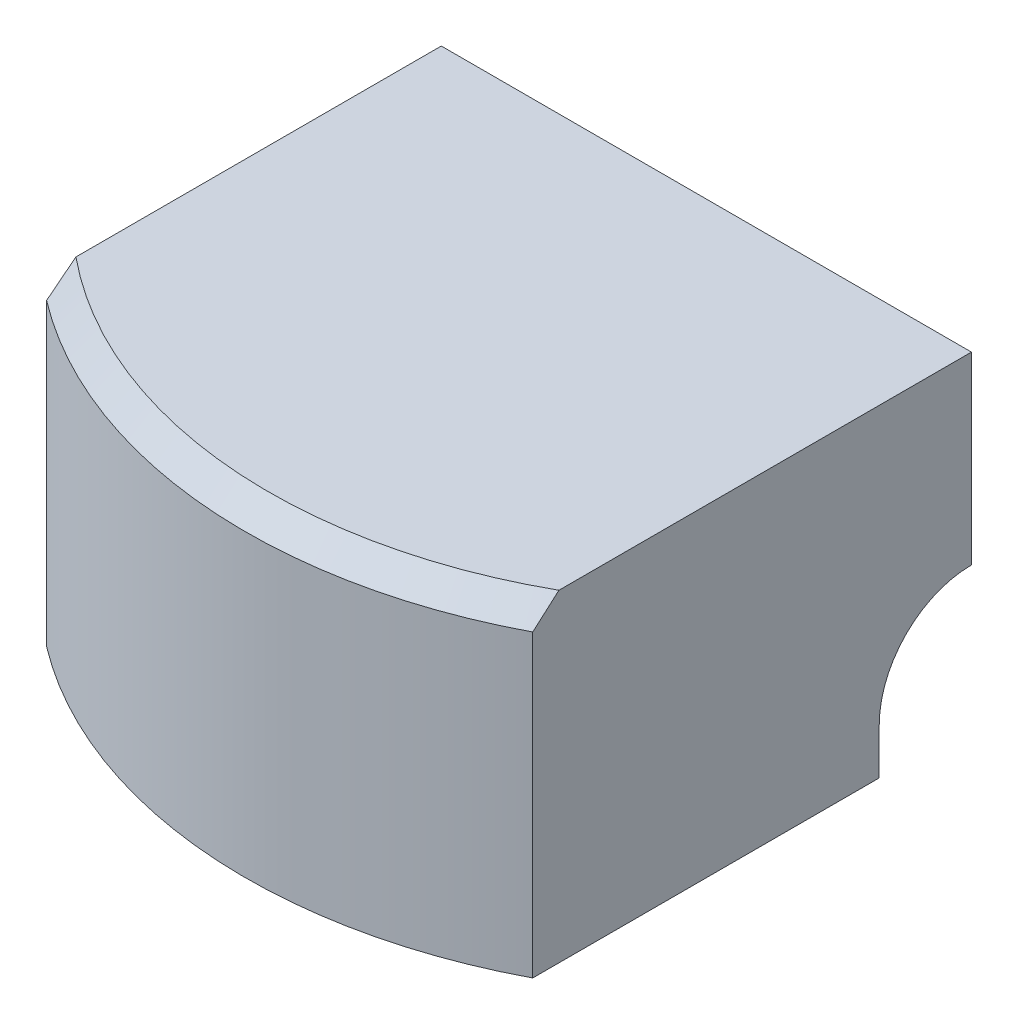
ISO-10303-21;
HEADER;
FILE_DESCRIPTION(('STEP AP214'),'2;1');
FILE_NAME('part.step','',(''),(''),'','','');
FILE_SCHEMA(('AUTOMOTIVE_DESIGN { 1 0 10303 214 1 1 1 1 }'));
ENDSEC;
DATA;
#1=APPLICATION_CONTEXT('core data for automotive mechanical design processes');
#2=APPLICATION_PROTOCOL_DEFINITION('international standard','automotive_design',2000,#1);
#3=PRODUCT_CONTEXT('',#1,'mechanical');
#4=PRODUCT('Part','Part','',(#3));
#5=PRODUCT_RELATED_PRODUCT_CATEGORY('part','',(#4));
#6=PRODUCT_DEFINITION_FORMATION('','',#4);
#7=PRODUCT_DEFINITION_CONTEXT('part definition',#1,'design');
#8=PRODUCT_DEFINITION('design','',#6,#7);
#9=PRODUCT_DEFINITION_SHAPE('','',#8);
#10=(LENGTH_UNIT() NAMED_UNIT(*) SI_UNIT(.MILLI.,.METRE.));
#11=(NAMED_UNIT(*) PLANE_ANGLE_UNIT() SI_UNIT($,.RADIAN.));
#12=(NAMED_UNIT(*) SI_UNIT($,.STERADIAN.) SOLID_ANGLE_UNIT());
#13=UNCERTAINTY_MEASURE_WITH_UNIT(LENGTH_MEASURE(1.E-05),#10,'distance_accuracy_value','');
#14=(GEOMETRIC_REPRESENTATION_CONTEXT(3) GLOBAL_UNCERTAINTY_ASSIGNED_CONTEXT((#13)) GLOBAL_UNIT_ASSIGNED_CONTEXT((#10,
#11,#12)) REPRESENTATION_CONTEXT('',''));
#15=CARTESIAN_POINT('',(0.,0.,0.));
#16=DIRECTION('',(0.,0.,1.));
#17=DIRECTION('',(1.,0.,0.));
#18=AXIS2_PLACEMENT_3D('',#15,#16,#17);
#19=CARTESIAN_POINT('',(0.,12.7,0.));
#20=DIRECTION('',(0.,-1.,0.));
#21=DIRECTION('',(1.,0.,0.));
#22=AXIS2_PLACEMENT_3D('',#19,#20,#21);
#23=SPHERICAL_SURFACE('',#22,25.4);
#24=CARTESIAN_POINT('',(0.,12.7,-4.33050426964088E-13));
#25=DIRECTION('',(1.,0.,0.));
#26=DIRECTION('',(0.,0.,-1.));
#27=AXIS2_PLACEMENT_3D('',#24,#25,#26);
#28=CIRCLE('',#27,25.4);
#29=CARTESIAN_POINT('',(0.,12.7,25.3999999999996));
#30=VERTEX_POINT('',#29);
#31=CARTESIAN_POINT('',(0.,38.1,-4.33050426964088E-13));
#32=VERTEX_POINT('',#31);
#33=EDGE_CURVE('E202',#30,#32,#28,.F.);
#34=ORIENTED_EDGE('',*,*,#33,.F.);
#35=CARTESIAN_POINT('',(0.,12.7,0.));
#36=DIRECTION('',(0.,-1.,0.));
#37=DIRECTION('',(0.,0.,-1.));
#38=AXIS2_PLACEMENT_3D('',#35,#36,#37);
#39=CIRCLE('',#38,25.4);
#40=CARTESIAN_POINT('',(-25.4,12.7,0.));
#41=VERTEX_POINT('',#40);
#42=EDGE_CURVE('E184',#30,#41,#39,.T.);
#43=ORIENTED_EDGE('',*,*,#42,.T.);
#44=CARTESIAN_POINT('',(0.,12.7,0.));
#45=DIRECTION('',(0.,0.,1.));
#46=DIRECTION('',(-1.,0.,0.));
#47=AXIS2_PLACEMENT_3D('',#44,#45,#46);
#48=CIRCLE('',#47,25.4);
#49=EDGE_CURVE('E189',#32,#41,#48,.T.);
#50=ORIENTED_EDGE('',*,*,#49,.F.);
#51=EDGE_LOOP('',(#34,#43,#50));
#52=FACE_BOUND('',#51,.T.);
#53=ADVANCED_FACE('F33',(#52),#23,.F.);
#54=CARTESIAN_POINT('',(0.,0.,0.));
#55=DIRECTION('',(0.,-1.,0.));
#56=DIRECTION('',(0.,0.,-1.));
#57=AXIS2_PLACEMENT_3D('',#54,#55,#56);
#58=CYLINDRICAL_SURFACE('',#57,25.4);
#59=DIRECTION('',(0.,1.,0.));
#60=VECTOR('',#59,1.);
#61=CARTESIAN_POINT('',(0.,12.7,25.3999999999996));
#62=LINE('',#61,#60);
#63=CARTESIAN_POINT('',(0.,0.,25.3999999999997));
#64=VERTEX_POINT('',#63);
#65=EDGE_CURVE('E203',#64,#30,#62,.T.);
#66=ORIENTED_EDGE('',*,*,#65,.F.);
#67=CARTESIAN_POINT('',(0.,0.,0.));
#68=DIRECTION('',(0.,-1.,0.));
#69=DIRECTION('',(0.,0.,-1.));
#70=AXIS2_PLACEMENT_3D('',#67,#68,#69);
#71=CIRCLE('',#70,25.4);
#72=CARTESIAN_POINT('',(-25.4,0.,0.));
#73=VERTEX_POINT('',#72);
#74=EDGE_CURVE('E117',#64,#73,#71,.T.);
#75=ORIENTED_EDGE('',*,*,#74,.T.);
#76=DIRECTION('',(0.,1.,0.));
#77=VECTOR('',#76,1.);
#78=CARTESIAN_POINT('',(-25.4,0.,0.));
#79=LINE('',#78,#77);
#80=EDGE_CURVE('E191',#73,#41,#79,.T.);
#81=ORIENTED_EDGE('',*,*,#80,.T.);
#82=ORIENTED_EDGE('',*,*,#42,.F.);
#83=EDGE_LOOP('',(#66,#75,#81,#82));
#84=FACE_BOUND('',#83,.T.);
#85=ADVANCED_FACE('F162',(#84),#58,.F.);
#86=CARTESIAN_POINT('',(0.,88.9,0.));
#87=DIRECTION('',(0.,-1.,0.));
#88=DIRECTION('',(0.,0.,-1.));
#89=AXIS2_PLACEMENT_3D('',#86,#87,#88);
#90=PLANE('',#89);
#91=DIRECTION('',(1.,0.,0.));
#92=VECTOR('',#91,1.);
#93=CARTESIAN_POINT('',(0.,88.9,0.));
#94=LINE('',#93,#92);
#95=CARTESIAN_POINT('',(-82.55,88.9,5.76443569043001E-13));
#96=VERTEX_POINT('',#95);
#97=CARTESIAN_POINT('',(63.5,88.9,0.));
#98=VERTEX_POINT('',#97);
#99=EDGE_CURVE('E186',#96,#98,#94,.T.);
#100=ORIENTED_EDGE('',*,*,#99,.F.);
#101=DIRECTION('',(0.,0.,-1.));
#102=VECTOR('',#101,1.);
#103=CARTESIAN_POINT('',(-82.55,88.9,0.));
#104=LINE('',#103,#102);
#105=CARTESIAN_POINT('',(-82.55,88.9,100.653008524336));
#106=VERTEX_POINT('',#105);
#107=EDGE_CURVE('E56',#106,#96,#104,.T.);
#108=ORIENTED_EDGE('',*,*,#107,.F.);
#109=CARTESIAN_POINT('',(0.,88.9,0.));
#110=DIRECTION('',(0.,-1.,0.));
#111=DIRECTION('',(0.,0.,-1.));
#112=AXIS2_PLACEMENT_3D('',#109,#110,#111);
#113=CIRCLE('',#112,130.175);
#114=CARTESIAN_POINT('',(63.5,88.9,113.6366165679));
#115=VERTEX_POINT('',#114);
#116=EDGE_CURVE('E11',#115,#106,#113,.T.);
#117=ORIENTED_EDGE('',*,*,#116,.F.);
#118=DIRECTION('',(0.,0.,1.));
#119=VECTOR('',#118,1.);
#120=CARTESIAN_POINT('',(63.5,88.9,0.));
#121=LINE('',#120,#119);
#122=EDGE_CURVE('E125',#98,#115,#121,.T.);
#123=ORIENTED_EDGE('',*,*,#122,.F.);
#124=EDGE_LOOP('',(#100,#108,#117,#123));
#125=FACE_BOUND('',#124,.T.);
#126=ADVANCED_FACE('F35',(#125),#90,.F.);
#127=CARTESIAN_POINT('',(0.,88.9,0.));
#128=DIRECTION('',(0.,-1.,0.));
#129=DIRECTION('',(0.,0.,-1.));
#130=AXIS2_PLACEMENT_3D('',#127,#128,#129);
#131=CONICAL_SURFACE('',#130,130.175,0.785398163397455);
#132=ORIENTED_EDGE('',*,*,#116,.T.);
#133=CARTESIAN_POINT('',(-82.55,102.717281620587,-82.0037567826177));
#134=CARTESIAN_POINT('',(-82.55,103.527269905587,-80.8543967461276));
#135=CARTESIAN_POINT('',(-82.55,104.33157883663,-79.7010151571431));
#136=CARTESIAN_POINT('',(-82.55,105.927657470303,-77.3855538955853));
#137=CARTESIAN_POINT('',(-82.55,106.719426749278,-76.2234739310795));
#138=CARTESIAN_POINT('',(-82.55,108.289541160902,-73.8895175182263));
#139=CARTESIAN_POINT('',(-82.55,109.067880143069,-72.7176369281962));
#140=CARTESIAN_POINT('',(-82.55,110.609364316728,-70.3639304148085));
#141=CARTESIAN_POINT('',(-82.55,111.372509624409,-69.1821045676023));
#142=CARTESIAN_POINT('',(-82.55,112.891581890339,-66.7927901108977));
#143=CARTESIAN_POINT('',(-82.55,113.647295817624,-65.5851659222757));
#144=CARTESIAN_POINT('',(-82.55,115.139695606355,-63.1582197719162));
#145=CARTESIAN_POINT('',(-82.55,115.876381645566,-61.9388979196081));
#146=CARTESIAN_POINT('',(-82.55,117.32858539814,-59.4878558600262));
#147=CARTESIAN_POINT('',(-82.55,118.044105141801,-58.2561368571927));
#148=CARTESIAN_POINT('',(-82.55,119.45170535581,-55.7793565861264));
#149=CARTESIAN_POINT('',(-82.55,120.143785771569,-54.534295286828));
#150=CARTESIAN_POINT('',(-82.55,121.525373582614,-51.9866513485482));
#151=CARTESIAN_POINT('',(-82.55,122.213962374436,-50.6835696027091));
#152=CARTESIAN_POINT('',(-82.55,123.559923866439,-48.0613499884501));
#153=CARTESIAN_POINT('',(-82.55,124.21729651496,-46.7422120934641));
#154=CARTESIAN_POINT('',(-82.55,125.497266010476,-44.0867705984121));
#155=CARTESIAN_POINT('',(-82.55,126.119855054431,-42.7504632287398));
#156=CARTESIAN_POINT('',(-82.55,127.325973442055,-40.060290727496));
#157=CARTESIAN_POINT('',(-82.55,127.909502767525,-38.7064255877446));
#158=CARTESIAN_POINT('',(-82.55,129.030141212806,-35.9875043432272));
#159=CARTESIAN_POINT('',(-82.55,129.567468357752,-34.6225383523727));
#160=CARTESIAN_POINT('',(-82.55,130.59414127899,-31.874507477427));
#161=CARTESIAN_POINT('',(-82.55,131.083483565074,-30.4914412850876));
#162=CARTESIAN_POINT('',(-82.55,132.008747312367,-27.7083227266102));
#163=CARTESIAN_POINT('',(-82.55,132.444697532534,-26.3082799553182));
#164=CARTESIAN_POINT('',(-82.55,133.258141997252,-23.4914505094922));
#165=CARTESIAN_POINT('',(-82.55,133.635644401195,-22.0746662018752));
#166=CARTESIAN_POINT('',(-82.55,134.308175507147,-19.3033405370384));
#167=CARTESIAN_POINT('',(-82.55,134.606580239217,-17.9496207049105));
#168=CARTESIAN_POINT('',(-82.55,135.142360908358,-15.2302922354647));
#169=CARTESIAN_POINT('',(-82.55,135.379745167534,-13.864685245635));
#170=CARTESIAN_POINT('',(-82.55,135.789986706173,-11.123310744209));
#171=CARTESIAN_POINT('',(-82.55,135.962822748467,-9.74754004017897));
#172=CARTESIAN_POINT('',(-82.55,136.241021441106,-6.98914506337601));
#173=CARTESIAN_POINT('',(-82.55,136.346383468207,-5.60652072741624));
#174=CARTESIAN_POINT('',(-82.55,136.486814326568,-2.85725339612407));
#175=CARTESIAN_POINT('',(-82.55,136.52285390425,-1.49066013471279));
#176=CARTESIAN_POINT('',(-82.55,136.526959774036,1.24262089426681));
#177=CARTESIAN_POINT('',(-82.55,136.495026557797,2.60930866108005));
#178=CARTESIAN_POINT('',(-82.55,136.36373731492,5.33944850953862));
#179=CARTESIAN_POINT('',(-82.55,136.264380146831,6.70290053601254));
#180=CARTESIAN_POINT('',(-82.55,135.999914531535,9.42338949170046));
#181=CARTESIAN_POINT('',(-82.55,135.834805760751,10.7804263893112));
#182=CARTESIAN_POINT('',(-82.55,135.442419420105,13.4788607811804));
#183=CARTESIAN_POINT('',(-82.55,135.21544067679,14.8203019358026));
#184=CARTESIAN_POINT('',(-82.55,134.702337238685,17.4917785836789));
#185=CARTESIAN_POINT('',(-82.55,134.416212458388,18.8218140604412));
#186=CARTESIAN_POINT('',(-82.55,133.788666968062,21.4688052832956));
#187=CARTESIAN_POINT('',(-82.55,133.447243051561,22.7857602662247));
#188=CARTESIAN_POINT('',(-82.55,132.713257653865,25.405295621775));
#189=CARTESIAN_POINT('',(-82.55,132.320695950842,26.7078759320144));
#190=CARTESIAN_POINT('',(-82.55,131.485145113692,29.3088703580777));
#191=CARTESIAN_POINT('',(-82.55,131.041757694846,30.6071561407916));
#192=CARTESIAN_POINT('',(-82.55,130.111533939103,33.1880221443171));
#193=CARTESIAN_POINT('',(-82.55,129.624697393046,34.4706022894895));
#194=CARTESIAN_POINT('',(-82.55,128.611750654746,37.0197899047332));
#195=CARTESIAN_POINT('',(-82.55,128.085649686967,38.2864010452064));
#196=CARTESIAN_POINT('',(-82.55,127.269839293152,40.1747082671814));
#197=CARTESIAN_POINT('',(-82.55,126.993461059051,40.8022054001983));
#198=CARTESIAN_POINT('',(-82.55,126.432246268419,42.0534178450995));
#199=CARTESIAN_POINT('',(-82.55,126.147409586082,42.6771331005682));
#200=CARTESIAN_POINT('',(-82.55,125.26512715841,44.5765641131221));
#201=CARTESIAN_POINT('',(-82.55,124.654751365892,45.8462931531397));
#202=CARTESIAN_POINT('',(-82.55,123.403552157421,48.370706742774));
#203=CARTESIAN_POINT('',(-82.55,122.76272683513,49.6253903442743));
#204=CARTESIAN_POINT('',(-82.55,121.453583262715,52.1206959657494));
#205=CARTESIAN_POINT('',(-82.55,120.785258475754,53.3613145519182));
#206=CARTESIAN_POINT('',(-82.55,119.424035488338,55.8289464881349));
#207=CARTESIAN_POINT('',(-82.55,118.73113771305,57.0559600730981));
#208=CARTESIAN_POINT('',(-82.55,117.322472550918,59.4984939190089));
#209=CARTESIAN_POINT('',(-82.55,116.60668185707,60.714000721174));
#210=CARTESIAN_POINT('',(-82.55,115.155110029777,63.1330115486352));
#211=CARTESIAN_POINT('',(-82.55,114.41932881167,64.3365155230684));
#212=CARTESIAN_POINT('',(-82.55,112.929799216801,66.7321596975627));
#213=CARTESIAN_POINT('',(-82.55,112.176052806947,67.9243011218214));
#214=CARTESIAN_POINT('',(-82.55,110.652222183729,70.2981111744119));
#215=CARTESIAN_POINT('',(-82.55,109.882137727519,71.4797796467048));
#216=CARTESIAN_POINT('',(-82.55,108.324145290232,73.8379021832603));
#217=CARTESIAN_POINT('',(-82.55,107.536179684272,75.0143181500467));
#218=CARTESIAN_POINT('',(-82.55,105.946687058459,77.3579587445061));
#219=CARTESIAN_POINT('',(-82.55,105.145159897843,78.5251832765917));
#220=CARTESIAN_POINT('',(-82.55,102.722092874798,82.0140238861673));
#221=CARTESIAN_POINT('',(-82.55,101.082061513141,84.3228159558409));
#222=CARTESIAN_POINT('',(-82.55,97.7618646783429,88.9093605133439));
#223=CARTESIAN_POINT('',(-82.55,96.0817213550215,91.1871290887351));
#224=CARTESIAN_POINT('',(-82.55,92.6869148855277,95.7167354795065));
#225=CARTESIAN_POINT('',(-82.55,90.9722519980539,97.9685734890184));
#226=CARTESIAN_POINT('',(-82.55,87.5002475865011,102.466938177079));
#227=CARTESIAN_POINT('',(-82.55,85.7426784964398,104.713288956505));
#228=CARTESIAN_POINT('',(-82.55,82.202119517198,109.185848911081));
#229=CARTESIAN_POINT('',(-82.55,80.4191295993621,111.412058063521));
#230=CARTESIAN_POINT('',(-82.55,76.8310941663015,115.846988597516));
#231=CARTESIAN_POINT('',(-82.55,75.0260464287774,118.055708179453));
#232=CARTESIAN_POINT('',(-82.55,71.3969983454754,122.457506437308));
#233=CARTESIAN_POINT('',(-82.55,69.5729980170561,124.650585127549));
#234=CARTESIAN_POINT('',(-82.55,65.9123536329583,129.018252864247));
#235=CARTESIAN_POINT('',(-82.55,64.0757445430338,131.192871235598));
#236=CARTESIAN_POINT('',(-82.55,60.3880924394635,135.529829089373));
#237=CARTESIAN_POINT('',(-82.55,58.5370494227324,137.692168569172));
#238=CARTESIAN_POINT('',(-82.55,54.8223057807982,142.005798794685));
#239=CARTESIAN_POINT('',(-82.55,52.9586056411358,144.157089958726));
#240=CARTESIAN_POINT('',(-82.55,49.2199273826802,148.449841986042));
#241=CARTESIAN_POINT('',(-82.55,47.3449492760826,150.591302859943));
#242=CARTESIAN_POINT('',(-82.55,43.6122410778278,154.83436287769));
#243=CARTESIAN_POINT('',(-82.55,41.754655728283,156.936089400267));
#244=CARTESIAN_POINT('',(-82.55,38.0307471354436,161.131787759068));
#245=CARTESIAN_POINT('',(-82.55,36.1644238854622,163.225759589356));
#246=CARTESIAN_POINT('',(-82.55,32.423071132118,167.407625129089));
#247=CARTESIAN_POINT('',(-82.55,30.548038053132,169.495515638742));
#248=CARTESIAN_POINT('',(-82.55,26.7908777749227,173.664901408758));
#249=CARTESIAN_POINT('',(-82.55,24.9087505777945,175.746396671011));
#250=CARTESIAN_POINT('',(-82.55,21.160989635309,179.878293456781));
#251=CARTESIAN_POINT('',(-82.55,19.2954334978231,181.928765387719));
#252=CARTESIAN_POINT('',(-82.55,15.5586191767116,186.024507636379));
#253=CARTESIAN_POINT('',(-82.55,13.6873609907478,188.069777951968));
#254=CARTESIAN_POINT('',(-82.55,9.94052927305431,192.154589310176));
#255=CARTESIAN_POINT('',(-82.55,8.06495818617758,194.194132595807));
#256=CARTESIAN_POINT('',(-82.55,4.3090600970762,198.268829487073));
#257=CARTESIAN_POINT('',(-82.55,2.42873310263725,200.303983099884));
#258=CARTESIAN_POINT('',(-82.55,0.54624321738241,202.337132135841));
#259=B_SPLINE_CURVE_WITH_KNOTS('',3,(#133,#134,#135,#136,#137,#138,#139,#140,#141,#142,#143,
#144,#145,#146,#147,#148,#149,#150,#151,#152,#153,#154,#155,#156,#157,#158,#159,#160,#161,#162,
#163,#164,#165,#166,#167,#168,#169,#170,#171,#172,#173,#174,#175,#176,#177,#178,#179,#180,#181,
#182,#183,#184,#185,#186,#187,#188,#189,#190,#191,#192,#193,#194,#195,#196,#197,#198,#199,#200,
#201,#202,#203,#204,#205,#206,#207,#208,#209,#210,#211,#212,#213,#214,#215,#216,#217,#218,#219,
#220,#221,#222,#223,#224,#225,#226,#227,#228,#229,#230,#231,#232,#233,#234,#235,#236,#237,#238,
#239,#240,#241,#242,#243,#244,#245,#246,#247,#248,#249,#250,#251,#252,#253,#254,#255,#256,#257,
#258),.UNSPECIFIED.,.F.,.F.,(4,2,2,2,2,2,2,2,2,2,2,2,2,2,2,2,2,2,2,2,2,2,2,2,2,2,2,2,2,2,2,2,2,
2,2,2,2,2,2,2,2,2,2,2,2,2,2,2,2,2,2,2,2,2,2,2,2,2,2,2,2,2,4),(0.,4.21829773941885,
8.4367376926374,12.6570608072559,16.8773516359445,21.1509652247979,25.4245388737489,
29.6977012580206,33.9708735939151,38.3919862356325,42.8131061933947,47.235213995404,
51.6573238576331,56.0572673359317,60.4575306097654,64.8554132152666,69.2526813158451,
73.4100332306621,77.5668178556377,81.7249689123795,85.8831583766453,89.9826828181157,
94.082177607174,98.1817418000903,102.281326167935,106.361450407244,110.441580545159,
114.521947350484,118.602331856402,122.717214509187,126.832116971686,130.946055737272,
133.003000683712,135.059976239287,139.285934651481,143.512157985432,147.739391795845,
151.966552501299,156.198163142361,160.429791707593,164.66095908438,168.892189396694,
173.139859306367,177.387573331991,185.882969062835,194.37377744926,202.864522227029,
211.420961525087,219.97741046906,228.534728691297,237.092039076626,245.631223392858,
254.170409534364,262.70926993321,271.248121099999,279.663015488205,288.077916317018,
296.496646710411,304.915374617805,313.231769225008,321.548167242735,329.860652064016,
338.173123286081),.UNSPECIFIED.);
#260=CARTESIAN_POINT('',(-82.55,82.5500000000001,108.740853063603));
#261=VERTEX_POINT('',#260);
#262=EDGE_CURVE('E128',#106,#261,#259,.T.);
#263=ORIENTED_EDGE('',*,*,#262,.T.);
#264=CARTESIAN_POINT('',(0.,82.5500000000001,0.));
#265=DIRECTION('',(0.,-1.,0.));
#266=DIRECTION('',(0.,0.,-1.));
#267=AXIS2_PLACEMENT_3D('',#264,#265,#266);
#268=CIRCLE('',#267,136.525);
#269=CARTESIAN_POINT('',(63.5,82.5500000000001,120.858701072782));
#270=VERTEX_POINT('',#269);
#271=EDGE_CURVE('E41',#270,#261,#268,.T.);
#272=ORIENTED_EDGE('',*,*,#271,.F.);
#273=CARTESIAN_POINT('',(63.5,0.546243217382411,209.09942023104));
#274=CARTESIAN_POINT('',(63.5,2.40256457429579,207.159382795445));
#275=CARTESIAN_POINT('',(63.5,4.25775280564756,205.218261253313));
#276=CARTESIAN_POINT('',(63.5,7.96565589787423,201.333655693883));
#277=CARTESIAN_POINT('',(63.5,9.81837075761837,199.390171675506));
#278=CARTESIAN_POINT('',(63.5,15.3725169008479,193.555861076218));
#279=CARTESIAN_POINT('',(63.5,19.0699248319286,189.661201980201));
#280=CARTESIAN_POINT('',(63.5,26.4529018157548,181.858780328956));
#281=CARTESIAN_POINT('',(63.5,30.138467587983,177.951014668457));
#282=CARTESIAN_POINT('',(63.5,37.494160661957,170.120993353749));
#283=CARTESIAN_POINT('',(63.5,41.1642880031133,166.198737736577));
#284=CARTESIAN_POINT('',(63.5,48.5005967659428,158.320715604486));
#285=CARTESIAN_POINT('',(63.5,52.166701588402,154.364877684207));
#286=CARTESIAN_POINT('',(63.5,57.6481876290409,148.414819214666));
#287=CARTESIAN_POINT('',(63.5,59.4724109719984,146.428742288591));
#288=CARTESIAN_POINT('',(63.5,63.1142334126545,142.450525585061));
#289=CARTESIAN_POINT('',(63.5,64.9318325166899,140.458385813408));
#290=CARTESIAN_POINT('',(63.5,68.5593672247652,136.467569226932));
#291=CARTESIAN_POINT('',(63.5,70.3693037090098,134.468893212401));
#292=CARTESIAN_POINT('',(63.5,73.9807494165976,130.463945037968));
#293=CARTESIAN_POINT('',(63.5,75.7822586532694,128.45767289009));
#294=CARTESIAN_POINT('',(63.5,79.375682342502,124.436584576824));
#295=CARTESIAN_POINT('',(63.5,81.1675968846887,122.421768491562));
#296=CARTESIAN_POINT('',(63.5,84.7404680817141,118.382449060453));
#297=CARTESIAN_POINT('',(63.5,86.5214247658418,116.357945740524));
#298=CARTESIAN_POINT('',(63.5,90.132880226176,112.22683004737));
#299=CARTESIAN_POINT('',(63.5,91.9629300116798,110.119824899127));
#300=CARTESIAN_POINT('',(63.5,95.607309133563,105.892250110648));
#301=CARTESIAN_POINT('',(63.5,97.4216384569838,103.771680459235));
#302=CARTESIAN_POINT('',(63.5,101.032085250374,99.5145828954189));
#303=CARTESIAN_POINT('',(63.5,102.828200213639,97.3780528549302));
#304=CARTESIAN_POINT('',(63.5,106.398550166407,93.0867843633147));
#305=CARTESIAN_POINT('',(63.5,108.172785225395,90.9320459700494));
#306=CARTESIAN_POINT('',(63.5,111.694944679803,86.6014704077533));
#307=CARTESIAN_POINT('',(63.5,113.44287161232,84.4256353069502));
#308=CARTESIAN_POINT('',(63.5,116.041024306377,81.1430595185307));
#309=CARTESIAN_POINT('',(63.5,116.903131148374,80.0457144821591));
#310=CARTESIAN_POINT('',(63.5,118.618578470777,77.844196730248));
#311=CARTESIAN_POINT('',(63.5,119.471918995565,76.7400240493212));
#312=CARTESIAN_POINT('',(63.5,121.168718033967,74.5244743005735));
#313=CARTESIAN_POINT('',(63.5,122.012178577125,73.4130987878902));
#314=CARTESIAN_POINT('',(63.5,123.68830984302,71.1822486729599));
#315=CARTESIAN_POINT('',(63.5,124.520980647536,70.062774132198));
#316=CARTESIAN_POINT('',(63.5,126.174266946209,67.8150130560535));
#317=CARTESIAN_POINT('',(63.5,126.994882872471,66.686726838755));
#318=CARTESIAN_POINT('',(63.5,128.622646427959,64.420492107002));
#319=CARTESIAN_POINT('',(63.5,129.429794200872,63.2825436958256));
#320=CARTESIAN_POINT('',(63.5,131.121575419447,60.8636705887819));
#321=CARTESIAN_POINT('',(63.5,132.004357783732,59.581449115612));
#322=CARTESIAN_POINT('',(63.5,133.748413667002,57.0024451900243));
#323=CARTESIAN_POINT('',(63.5,134.609687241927,55.7056627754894));
#324=CARTESIAN_POINT('',(63.5,136.307716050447,53.0957223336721));
#325=CARTESIAN_POINT('',(63.5,137.144466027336,51.7825608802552));
#326=CARTESIAN_POINT('',(63.5,138.789459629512,49.1384714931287));
#327=CARTESIAN_POINT('',(63.5,139.597703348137,47.8075436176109));
#328=CARTESIAN_POINT('',(63.5,141.181109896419,45.1262522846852));
#329=CARTESIAN_POINT('',(63.5,141.956275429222,43.7758904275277));
#330=CARTESIAN_POINT('',(63.5,143.468258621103,41.0537503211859));
#331=CARTESIAN_POINT('',(63.5,144.205075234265,39.6819714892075));
#332=CARTESIAN_POINT('',(63.5,145.63375298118,36.9157026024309));
#333=CARTESIAN_POINT('',(63.5,146.32562883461,35.5212201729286));
#334=CARTESIAN_POINT('',(63.5,147.657218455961,32.7075708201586));
#335=CARTESIAN_POINT('',(63.5,148.296936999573,31.2884061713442));
#336=CARTESIAN_POINT('',(63.5,149.312990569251,28.9004471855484));
#337=CARTESIAN_POINT('',(63.5,149.706173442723,27.9388092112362));
#338=CARTESIAN_POINT('',(63.5,150.462662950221,26.0037668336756));
#339=CARTESIAN_POINT('',(63.5,150.825968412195,25.0303619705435));
#340=CARTESIAN_POINT('',(63.5,151.519676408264,23.0718509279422));
#341=CARTESIAN_POINT('',(63.5,151.850078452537,22.086744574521));
#342=CARTESIAN_POINT('',(63.5,152.474802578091,20.1052270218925));
#343=CARTESIAN_POINT('',(63.5,152.769128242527,19.1088169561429));
#344=CARTESIAN_POINT('',(63.5,153.317525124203,17.1089623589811));
#345=CARTESIAN_POINT('',(63.5,153.571743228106,16.1055582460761));
#346=CARTESIAN_POINT('',(63.5,154.038180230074,14.0890039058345));
#347=CARTESIAN_POINT('',(63.5,154.250399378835,13.0758537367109));
#348=CARTESIAN_POINT('',(63.5,154.629985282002,11.04122423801));
#349=CARTESIAN_POINT('',(63.5,154.797355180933,10.0197454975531));
#350=CARTESIAN_POINT('',(63.5,155.084817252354,7.97012911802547));
#351=CARTESIAN_POINT('',(63.5,155.204909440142,6.9419914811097));
#352=CARTESIAN_POINT('',(63.5,155.397010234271,4.86956746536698));
#353=CARTESIAN_POINT('',(63.5,155.46846394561,3.82522936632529));
#354=CARTESIAN_POINT('',(63.5,155.55990811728,1.73429303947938));
#355=CARTESIAN_POINT('',(63.5,155.579898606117,0.687694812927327));
#356=CARTESIAN_POINT('',(63.5,155.568074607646,-1.40519590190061));
#357=CARTESIAN_POINT('',(63.5,155.536260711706,-2.45148839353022));
#358=CARTESIAN_POINT('',(63.5,155.421371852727,-4.54124596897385));
#359=CARTESIAN_POINT('',(63.5,155.338296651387,-5.58471103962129));
#360=CARTESIAN_POINT('',(63.5,155.122002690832,-7.66895489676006));
#361=CARTESIAN_POINT('',(63.5,154.988663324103,-8.70972111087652));
#362=CARTESIAN_POINT('',(63.5,154.673973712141,-10.7839301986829));
#363=CARTESIAN_POINT('',(63.5,154.492623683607,-11.8173731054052));
#364=CARTESIAN_POINT('',(63.5,154.084554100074,-13.8753546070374));
#365=CARTESIAN_POINT('',(63.5,153.857829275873,-14.8998921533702));
#366=CARTESIAN_POINT('',(63.5,153.362051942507,-16.9387008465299));
#367=CARTESIAN_POINT('',(63.5,153.092996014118,-17.9529711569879));
#368=CARTESIAN_POINT('',(63.5,152.389978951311,-20.4099907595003));
#369=CARTESIAN_POINT('',(63.5,151.935254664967,-21.8468197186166));
#370=CARTESIAN_POINT('',(63.5,150.954847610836,-24.696063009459));
#371=CARTESIAN_POINT('',(63.5,150.429154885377,-26.1084738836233));
#372=CARTESIAN_POINT('',(63.5,149.315740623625,-28.9094591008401));
#373=CARTESIAN_POINT('',(63.5,148.72798354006,-30.2980192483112));
#374=CARTESIAN_POINT('',(63.5,147.499093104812,-33.0511415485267));
#375=CARTESIAN_POINT('',(63.5,146.857961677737,-34.4157045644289));
#376=CARTESIAN_POINT('',(63.5,145.525412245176,-37.1308490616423));
#377=CARTESIAN_POINT('',(63.5,144.833697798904,-38.4812845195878));
#378=CARTESIAN_POINT('',(63.5,143.41013769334,-41.1607782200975));
#379=CARTESIAN_POINT('',(63.5,142.678291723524,-42.4898362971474));
#380=CARTESIAN_POINT('',(63.5,141.180257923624,-45.1278083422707));
#381=CARTESIAN_POINT('',(63.5,140.414081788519,-46.4367289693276));
#382=CARTESIAN_POINT('',(63.5,138.85184250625,-49.0365631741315));
#383=CARTESIAN_POINT('',(63.5,138.055779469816,-50.3274768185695));
#384=CARTESIAN_POINT('',(63.5,136.405786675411,-52.943549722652));
#385=CARTESIAN_POINT('',(63.5,135.550813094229,-54.2680495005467));
#386=CARTESIAN_POINT('',(63.5,133.816588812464,-56.9010353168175));
#387=CARTESIAN_POINT('',(63.5,132.937338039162,-58.2095213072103));
#388=CARTESIAN_POINT('',(63.5,131.157582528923,-60.8122022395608));
#389=CARTESIAN_POINT('',(63.5,130.257074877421,-62.1063951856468));
#390=CARTESIAN_POINT('',(63.5,128.437578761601,-64.6817010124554));
#391=CARTESIAN_POINT('',(63.5,127.518590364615,-65.9628139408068));
#392=CARTESIAN_POINT('',(63.5,125.682064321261,-68.4888897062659));
#393=CARTESIAN_POINT('',(63.5,124.76483355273,-69.7340759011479));
#394=CARTESIAN_POINT('',(63.5,122.916540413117,-72.2141453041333));
#395=CARTESIAN_POINT('',(63.5,121.985477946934,-73.4490284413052));
#396=CARTESIAN_POINT('',(63.5,120.111566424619,-75.9088016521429));
#397=CARTESIAN_POINT('',(63.5,119.168723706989,-77.1336965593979));
#398=CARTESIAN_POINT('',(63.5,117.272096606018,-79.5749285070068));
#399=CARTESIAN_POINT('',(63.5,116.318312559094,-80.79126580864));
#400=CARTESIAN_POINT('',(63.5,115.359687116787,-82.0037567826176));
#401=B_SPLINE_CURVE_WITH_KNOTS('',3,(#273,#274,#275,#276,#277,#278,#279,#280,#281,#282,#283,
#284,#285,#286,#287,#288,#289,#290,#291,#292,#293,#294,#295,#296,#297,#298,#299,#300,#301,#302,
#303,#304,#305,#306,#307,#308,#309,#310,#311,#312,#313,#314,#315,#316,#317,#318,#319,#320,#321,
#322,#323,#324,#325,#326,#327,#328,#329,#330,#331,#332,#333,#334,#335,#336,#337,#338,#339,#340,
#341,#342,#343,#344,#345,#346,#347,#348,#349,#350,#351,#352,#353,#354,#355,#356,#357,#358,#359,
#360,#361,#362,#363,#364,#365,#366,#367,#368,#369,#370,#371,#372,#373,#374,#375,#376,#377,#378,
#379,#380,#381,#382,#383,#384,#385,#386,#387,#388,#389,#390,#391,#392,#393,#394,#395,#396,#397,
#398,#399,#400),.UNSPECIFIED.,.F.,.F.,(4,2,2,2,2,2,2,2,2,2,2,2,2,2,2,2,2,2,2,2,2,2,2,2,2,2,2,2,
2,2,2,2,2,2,2,2,2,2,2,2,2,2,2,2,2,2,2,2,2,2,2,2,2,2,2,2,2,2,2,2,2,2,2,4),(0.,8.05525012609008,
16.1105039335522,32.2211196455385,48.335868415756,64.4505760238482,80.6307484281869,
88.720892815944,96.8110294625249,104.900210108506,112.989377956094,121.078470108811,
129.167540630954,137.539867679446,145.912201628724,154.285672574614,162.659116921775,
171.031748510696,175.218184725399,179.404599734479,183.590139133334,187.775646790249,
191.96100405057,196.146316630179,200.816302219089,205.486275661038,210.15724291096,
214.828194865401,219.498764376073,224.169461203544,228.838620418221,233.50735162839,
236.623663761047,239.740098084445,242.856578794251,245.97274971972,249.077229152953,
252.181690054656,255.2859332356,258.390175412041,261.529264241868,264.668351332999,
267.807402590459,270.946468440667,274.093114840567,277.23974703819,280.386744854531,
283.533996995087,288.052956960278,292.572551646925,297.094749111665,301.616783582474,
306.16785231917,310.718956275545,315.268521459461,319.818069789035,324.547193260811,
329.276330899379,334.006120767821,338.735893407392,343.375421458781,348.014981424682,
352.652144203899,357.289164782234),.UNSPECIFIED.);
#402=EDGE_CURVE('E138',#270,#115,#401,.T.);
#403=ORIENTED_EDGE('',*,*,#402,.T.);
#404=EDGE_LOOP('',(#132,#263,#272,#403));
#405=FACE_BOUND('',#404,.T.);
#406=ADVANCED_FACE('F147',(#405),#131,.T.);
#407=CARTESIAN_POINT('',(0.,0.,0.));
#408=DIRECTION('',(0.,-1.,0.));
#409=DIRECTION('',(0.,0.,-1.));
#410=AXIS2_PLACEMENT_3D('',#407,#408,#409);
#411=CYLINDRICAL_SURFACE('',#410,136.525);
#412=ORIENTED_EDGE('',*,*,#271,.T.);
#413=DIRECTION('',(0.,-1.,0.));
#414=VECTOR('',#413,1.);
#415=CARTESIAN_POINT('',(-82.55,0.,108.740853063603));
#416=LINE('',#415,#414);
#417=CARTESIAN_POINT('',(-82.55,0.,108.740853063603));
#418=VERTEX_POINT('',#417);
#419=EDGE_CURVE('E178',#261,#418,#416,.T.);
#420=ORIENTED_EDGE('',*,*,#419,.T.);
#421=CARTESIAN_POINT('',(0.,0.,0.));
#422=DIRECTION('',(0.,-1.,0.));
#423=DIRECTION('',(0.,0.,-1.));
#424=AXIS2_PLACEMENT_3D('',#421,#422,#423);
#425=CIRCLE('',#424,136.525);
#426=CARTESIAN_POINT('',(63.5,0.,120.858701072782));
#427=VERTEX_POINT('',#426);
#428=EDGE_CURVE('E180',#427,#418,#425,.T.);
#429=ORIENTED_EDGE('',*,*,#428,.F.);
#430=DIRECTION('',(0.,-1.,0.));
#431=VECTOR('',#430,1.);
#432=CARTESIAN_POINT('',(63.5,0.,120.858701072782));
#433=LINE('',#432,#431);
#434=EDGE_CURVE('E122',#427,#270,#433,.F.);
#435=ORIENTED_EDGE('',*,*,#434,.T.);
#436=EDGE_LOOP('',(#412,#420,#429,#435));
#437=FACE_BOUND('',#436,.T.);
#438=ADVANCED_FACE('F168',(#437),#411,.T.);
#439=CARTESIAN_POINT('',(25.4,0.,-1.77367252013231E-13));
#440=DIRECTION('',(0.,1.,0.));
#441=DIRECTION('',(0.,0.,1.));
#442=AXIS2_PLACEMENT_3D('',#439,#440,#441);
#443=PLANE('',#442);
#444=ORIENTED_EDGE('',*,*,#74,.F.);
#445=DIRECTION('',(1.,0.,0.));
#446=VECTOR('',#445,1.);
#447=CARTESIAN_POINT('',(-45.7905011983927,0.,25.3999999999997));
#448=LINE('',#447,#446);
#449=CARTESIAN_POINT('',(63.5,0.,25.3999999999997));
#450=VERTEX_POINT('',#449);
#451=EDGE_CURVE('E104',#64,#450,#448,.T.);
#452=ORIENTED_EDGE('',*,*,#451,.T.);
#453=DIRECTION('',(0.,0.,1.));
#454=VECTOR('',#453,1.);
#455=CARTESIAN_POINT('',(63.5,0.,0.));
#456=LINE('',#455,#454);
#457=EDGE_CURVE('E114',#450,#427,#456,.T.);
#458=ORIENTED_EDGE('',*,*,#457,.T.);
#459=ORIENTED_EDGE('',*,*,#428,.T.);
#460=DIRECTION('',(0.,0.,-1.));
#461=VECTOR('',#460,1.);
#462=CARTESIAN_POINT('',(-82.55,0.,0.));
#463=LINE('',#462,#461);
#464=CARTESIAN_POINT('',(-82.55,0.,0.));
#465=VERTEX_POINT('',#464);
#466=EDGE_CURVE('E197',#418,#465,#463,.T.);
#467=ORIENTED_EDGE('',*,*,#466,.T.);
#468=DIRECTION('',(1.,0.,0.));
#469=VECTOR('',#468,1.);
#470=CARTESIAN_POINT('',(-25.4,0.,0.));
#471=LINE('',#470,#469);
#472=EDGE_CURVE('E145',#465,#73,#471,.T.);
#473=ORIENTED_EDGE('',*,*,#472,.T.);
#474=EDGE_LOOP('',(#444,#452,#458,#459,#467,#473));
#475=FACE_BOUND('',#474,.T.);
#476=ADVANCED_FACE('F112',(#475),#443,.F.);
#477=CARTESIAN_POINT('',(0.,12.7,0.));
#478=DIRECTION('',(0.,0.,-1.));
#479=DIRECTION('',(-1.,0.,0.));
#480=AXIS2_PLACEMENT_3D('',#477,#478,#479);
#481=PLANE('',#480);
#482=DIRECTION('',(1.,0.,0.));
#483=VECTOR('',#482,1.);
#484=CARTESIAN_POINT('',(-45.7905011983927,38.1,-4.25574169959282E-13));
#485=LINE('',#484,#483);
#486=CARTESIAN_POINT('',(63.5,38.1,-4.43418130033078E-13));
#487=VERTEX_POINT('',#486);
#488=EDGE_CURVE('E118',#32,#487,#485,.T.);
#489=ORIENTED_EDGE('',*,*,#488,.F.);
#490=ORIENTED_EDGE('',*,*,#49,.T.);
#491=ORIENTED_EDGE('',*,*,#80,.F.);
#492=ORIENTED_EDGE('',*,*,#472,.F.);
#493=DIRECTION('',(0.,1.,0.));
#494=VECTOR('',#493,1.);
#495=CARTESIAN_POINT('',(-82.55,0.,0.));
#496=LINE('',#495,#494);
#497=EDGE_CURVE('E209',#465,#96,#496,.T.);
#498=ORIENTED_EDGE('',*,*,#497,.T.);
#499=ORIENTED_EDGE('',*,*,#99,.T.);
#500=DIRECTION('',(0.,1.,0.));
#501=VECTOR('',#500,1.);
#502=CARTESIAN_POINT('',(63.5,0.,0.));
#503=LINE('',#502,#501);
#504=EDGE_CURVE('E124',#487,#98,#503,.T.);
#505=ORIENTED_EDGE('',*,*,#504,.F.);
#506=EDGE_LOOP('',(#489,#490,#491,#492,#498,#499,#505));
#507=FACE_BOUND('',#506,.T.);
#508=ADVANCED_FACE('F154',(#507),#481,.T.);
#509=CARTESIAN_POINT('',(63.5,0.,0.));
#510=DIRECTION('',(-1.,0.,0.));
#511=DIRECTION('',(0.,0.,1.));
#512=AXIS2_PLACEMENT_3D('',#509,#510,#511);
#513=PLANE('',#512);
#514=DIRECTION('',(0.,-1.,0.));
#515=VECTOR('',#514,1.);
#516=CARTESIAN_POINT('',(63.5,12.7,25.3999999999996));
#517=LINE('',#516,#515);
#518=CARTESIAN_POINT('',(63.5,12.7,25.3999999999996));
#519=VERTEX_POINT('',#518);
#520=EDGE_CURVE('E101',#519,#450,#517,.T.);
#521=ORIENTED_EDGE('',*,*,#520,.F.);
#522=CARTESIAN_POINT('',(63.5,12.7,-4.43418130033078E-13));
#523=DIRECTION('',(1.,0.,0.));
#524=DIRECTION('',(0.,0.,-1.));
#525=AXIS2_PLACEMENT_3D('',#522,#523,#524);
#526=CIRCLE('',#525,25.4);
#527=EDGE_CURVE('E48',#487,#519,#526,.T.);
#528=ORIENTED_EDGE('',*,*,#527,.F.);
#529=ORIENTED_EDGE('',*,*,#504,.T.);
#530=ORIENTED_EDGE('',*,*,#122,.T.);
#531=ORIENTED_EDGE('',*,*,#402,.F.);
#532=ORIENTED_EDGE('',*,*,#434,.F.);
#533=ORIENTED_EDGE('',*,*,#457,.F.);
#534=EDGE_LOOP('',(#521,#528,#529,#530,#531,#532,#533));
#535=FACE_BOUND('',#534,.T.);
#536=ADVANCED_FACE('F120',(#535),#513,.F.);
#537=CARTESIAN_POINT('',(-82.55,0.,0.));
#538=DIRECTION('',(1.,0.,0.));
#539=DIRECTION('',(0.,0.,-1.));
#540=AXIS2_PLACEMENT_3D('',#537,#538,#539);
#541=PLANE('',#540);
#542=ORIENTED_EDGE('',*,*,#107,.T.);
#543=ORIENTED_EDGE('',*,*,#497,.F.);
#544=ORIENTED_EDGE('',*,*,#466,.F.);
#545=ORIENTED_EDGE('',*,*,#419,.F.);
#546=ORIENTED_EDGE('',*,*,#262,.F.);
#547=EDGE_LOOP('',(#542,#543,#544,#545,#546));
#548=FACE_BOUND('',#547,.T.);
#549=ADVANCED_FACE('F153',(#548),#541,.F.);
#550=CARTESIAN_POINT('',(-45.7905011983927,12.7,-4.25574169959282E-13));
#551=DIRECTION('',(1.,0.,0.));
#552=DIRECTION('',(0.,0.,-1.));
#553=AXIS2_PLACEMENT_3D('',#550,#551,#552);
#554=CYLINDRICAL_SURFACE('',#553,25.4);
#555=ORIENTED_EDGE('',*,*,#33,.T.);
#556=ORIENTED_EDGE('',*,*,#488,.T.);
#557=ORIENTED_EDGE('',*,*,#527,.T.);
#558=DIRECTION('',(1.,0.,0.));
#559=VECTOR('',#558,1.);
#560=CARTESIAN_POINT('',(-45.7905011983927,12.7,25.3999999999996));
#561=LINE('',#560,#559);
#562=EDGE_CURVE('E106',#30,#519,#561,.T.);
#563=ORIENTED_EDGE('',*,*,#562,.F.);
#564=EDGE_LOOP('',(#555,#556,#557,#563));
#565=FACE_BOUND('',#564,.T.);
#566=ADVANCED_FACE('F217',(#565),#554,.F.);
#567=CARTESIAN_POINT('',(-45.7905011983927,12.7,25.3999999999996));
#568=DIRECTION('',(0.,0.,1.));
#569=DIRECTION('',(0.,-1.,0.));
#570=AXIS2_PLACEMENT_3D('',#567,#568,#569);
#571=PLANE('',#570);
#572=ORIENTED_EDGE('',*,*,#65,.T.);
#573=ORIENTED_EDGE('',*,*,#562,.T.);
#574=ORIENTED_EDGE('',*,*,#520,.T.);
#575=ORIENTED_EDGE('',*,*,#451,.F.);
#576=EDGE_LOOP('',(#572,#573,#574,#575));
#577=FACE_BOUND('',#576,.T.);
#578=ADVANCED_FACE('F103',(#577),#571,.F.);
#579=CLOSED_SHELL('',(#53,#85,#126,#406,#438,#476,#508,#536,#549,#566,#578));
#580=MANIFOLD_SOLID_BREP('B2',#579);
#581=ADVANCED_BREP_SHAPE_REPRESENTATION('',(#18,#580),#14);
#582=SHAPE_DEFINITION_REPRESENTATION(#9,#581);
ENDSEC;
END-ISO-10303-21;
